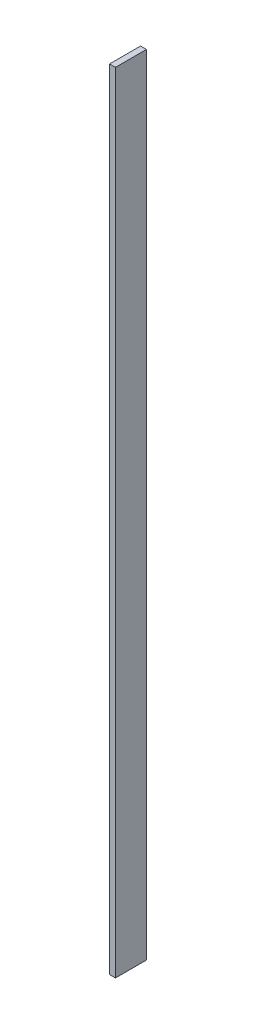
ISO-10303-21;
HEADER;
FILE_DESCRIPTION(('STEP AP214'),'2;1');
FILE_NAME('part.step','',(''),(''),'','','');
FILE_SCHEMA(('AUTOMOTIVE_DESIGN { 1 0 10303 214 1 1 1 1 }'));
ENDSEC;
DATA;
#1=APPLICATION_CONTEXT('core data for automotive mechanical design processes');
#2=APPLICATION_PROTOCOL_DEFINITION('international standard','automotive_design',2000,#1);
#3=PRODUCT_CONTEXT('',#1,'mechanical');
#4=PRODUCT('Part','Part','',(#3));
#5=PRODUCT_RELATED_PRODUCT_CATEGORY('part','',(#4));
#6=PRODUCT_DEFINITION_FORMATION('','',#4);
#7=PRODUCT_DEFINITION_CONTEXT('part definition',#1,'design');
#8=PRODUCT_DEFINITION('design','',#6,#7);
#9=PRODUCT_DEFINITION_SHAPE('','',#8);
#10=(LENGTH_UNIT() NAMED_UNIT(*) SI_UNIT(.MILLI.,.METRE.));
#11=(NAMED_UNIT(*) PLANE_ANGLE_UNIT() SI_UNIT($,.RADIAN.));
#12=(NAMED_UNIT(*) SI_UNIT($,.STERADIAN.) SOLID_ANGLE_UNIT());
#13=UNCERTAINTY_MEASURE_WITH_UNIT(LENGTH_MEASURE(1.E-05),#10,'distance_accuracy_value','');
#14=(GEOMETRIC_REPRESENTATION_CONTEXT(3) GLOBAL_UNCERTAINTY_ASSIGNED_CONTEXT((#13)) GLOBAL_UNIT_ASSIGNED_CONTEXT((#10,
#11,#12)) REPRESENTATION_CONTEXT('',''));
#15=CARTESIAN_POINT('',(0.,0.,0.));
#16=DIRECTION('',(0.,0.,1.));
#17=DIRECTION('',(1.,0.,0.));
#18=AXIS2_PLACEMENT_3D('',#15,#16,#17);
#19=CARTESIAN_POINT('',(0.,0.,31.5));
#20=DIRECTION('',(0.,0.,1.));
#21=DIRECTION('',(1.,0.,0.));
#22=AXIS2_PLACEMENT_3D('',#19,#20,#21);
#23=PLANE('',#22);
#24=DIRECTION('',(1.,0.,0.));
#25=VECTOR('',#24,1.);
#26=CARTESIAN_POINT('',(-3.,-400.,31.5));
#27=LINE('',#26,#25);
#28=CARTESIAN_POINT('',(-3.,-400.,31.5));
#29=VERTEX_POINT('',#28);
#30=CARTESIAN_POINT('',(3.,-400.,31.5));
#31=VERTEX_POINT('',#30);
#32=EDGE_CURVE('E93',#29,#31,#27,.T.);
#33=ORIENTED_EDGE('',*,*,#32,.T.);
#34=DIRECTION('',(0.,1.,0.));
#35=VECTOR('',#34,1.);
#36=CARTESIAN_POINT('',(3.,-400.,31.5));
#37=LINE('',#36,#35);
#38=CARTESIAN_POINT('',(3.,400.,31.5));
#39=VERTEX_POINT('',#38);
#40=EDGE_CURVE('E74',#31,#39,#37,.T.);
#41=ORIENTED_EDGE('',*,*,#40,.T.);
#42=DIRECTION('',(-1.,0.,0.));
#43=VECTOR('',#42,1.);
#44=CARTESIAN_POINT('',(3.,400.,31.5));
#45=LINE('',#44,#43);
#46=CARTESIAN_POINT('',(-3.,400.,31.5));
#47=VERTEX_POINT('',#46);
#48=EDGE_CURVE('E79',#39,#47,#45,.T.);
#49=ORIENTED_EDGE('',*,*,#48,.T.);
#50=DIRECTION('',(0.,-1.,0.));
#51=VECTOR('',#50,1.);
#52=CARTESIAN_POINT('',(-3.,400.,31.5));
#53=LINE('',#52,#51);
#54=EDGE_CURVE('E10',#47,#29,#53,.T.);
#55=ORIENTED_EDGE('',*,*,#54,.T.);
#56=EDGE_LOOP('',(#33,#41,#49,#55));
#57=FACE_BOUND('',#56,.T.);
#58=ADVANCED_FACE('F16',(#57),#23,.T.);
#59=CARTESIAN_POINT('',(0.,0.,0.));
#60=DIRECTION('',(0.,0.,1.));
#61=DIRECTION('',(1.,0.,0.));
#62=AXIS2_PLACEMENT_3D('',#59,#60,#61);
#63=PLANE('',#62);
#64=DIRECTION('',(0.,-1.,0.));
#65=VECTOR('',#64,1.);
#66=CARTESIAN_POINT('',(-3.,400.,0.));
#67=LINE('',#66,#65);
#68=CARTESIAN_POINT('',(-3.,400.,0.));
#69=VERTEX_POINT('',#68);
#70=CARTESIAN_POINT('',(-3.,-400.,0.));
#71=VERTEX_POINT('',#70);
#72=EDGE_CURVE('E20',#69,#71,#67,.T.);
#73=ORIENTED_EDGE('',*,*,#72,.F.);
#74=DIRECTION('',(-1.,0.,0.));
#75=VECTOR('',#74,1.);
#76=CARTESIAN_POINT('',(3.,400.,0.));
#77=LINE('',#76,#75);
#78=CARTESIAN_POINT('',(3.,400.,0.));
#79=VERTEX_POINT('',#78);
#80=EDGE_CURVE('E63',#79,#69,#77,.T.);
#81=ORIENTED_EDGE('',*,*,#80,.F.);
#82=DIRECTION('',(0.,1.,0.));
#83=VECTOR('',#82,1.);
#84=CARTESIAN_POINT('',(3.,-400.,0.));
#85=LINE('',#84,#83);
#86=CARTESIAN_POINT('',(3.,-400.,0.));
#87=VERTEX_POINT('',#86);
#88=EDGE_CURVE('E67',#87,#79,#85,.T.);
#89=ORIENTED_EDGE('',*,*,#88,.F.);
#90=DIRECTION('',(1.,0.,0.));
#91=VECTOR('',#90,1.);
#92=CARTESIAN_POINT('',(-3.,-400.,0.));
#93=LINE('',#92,#91);
#94=EDGE_CURVE('E110',#71,#87,#93,.T.);
#95=ORIENTED_EDGE('',*,*,#94,.F.);
#96=EDGE_LOOP('',(#73,#81,#89,#95));
#97=FACE_BOUND('',#96,.T.);
#98=ADVANCED_FACE('F18',(#97),#63,.F.);
#99=CARTESIAN_POINT('',(-3.,400.,0.));
#100=DIRECTION('',(1.,0.,0.));
#101=DIRECTION('',(0.,1.,0.));
#102=AXIS2_PLACEMENT_3D('',#99,#100,#101);
#103=PLANE('',#102);
#104=ORIENTED_EDGE('',*,*,#72,.T.);
#105=DIRECTION('',(0.,0.,1.));
#106=VECTOR('',#105,1.);
#107=CARTESIAN_POINT('',(-3.,-400.,0.));
#108=LINE('',#107,#106);
#109=EDGE_CURVE('E89',#71,#29,#108,.T.);
#110=ORIENTED_EDGE('',*,*,#109,.T.);
#111=ORIENTED_EDGE('',*,*,#54,.F.);
#112=DIRECTION('',(0.,0.,1.));
#113=VECTOR('',#112,1.);
#114=CARTESIAN_POINT('',(-3.,400.,0.));
#115=LINE('',#114,#113);
#116=EDGE_CURVE('E73',#69,#47,#115,.T.);
#117=ORIENTED_EDGE('',*,*,#116,.F.);
#118=EDGE_LOOP('',(#104,#110,#111,#117));
#119=FACE_BOUND('',#118,.T.);
#120=ADVANCED_FACE('F106',(#119),#103,.F.);
#121=CARTESIAN_POINT('',(3.,400.,0.));
#122=DIRECTION('',(0.,-1.,0.));
#123=DIRECTION('',(0.,0.,-1.));
#124=AXIS2_PLACEMENT_3D('',#121,#122,#123);
#125=PLANE('',#124);
#126=ORIENTED_EDGE('',*,*,#80,.T.);
#127=ORIENTED_EDGE('',*,*,#116,.T.);
#128=ORIENTED_EDGE('',*,*,#48,.F.);
#129=DIRECTION('',(0.,0.,1.));
#130=VECTOR('',#129,1.);
#131=CARTESIAN_POINT('',(3.,400.,0.));
#132=LINE('',#131,#130);
#133=EDGE_CURVE('E77',#79,#39,#132,.T.);
#134=ORIENTED_EDGE('',*,*,#133,.F.);
#135=EDGE_LOOP('',(#126,#127,#128,#134));
#136=FACE_BOUND('',#135,.T.);
#137=ADVANCED_FACE('F78',(#136),#125,.F.);
#138=CARTESIAN_POINT('',(3.,-400.,0.));
#139=DIRECTION('',(-1.,0.,0.));
#140=DIRECTION('',(0.,0.,1.));
#141=AXIS2_PLACEMENT_3D('',#138,#139,#140);
#142=PLANE('',#141);
#143=ORIENTED_EDGE('',*,*,#88,.T.);
#144=ORIENTED_EDGE('',*,*,#133,.T.);
#145=ORIENTED_EDGE('',*,*,#40,.F.);
#146=DIRECTION('',(0.,0.,1.));
#147=VECTOR('',#146,1.);
#148=CARTESIAN_POINT('',(3.,-400.,0.));
#149=LINE('',#148,#147);
#150=EDGE_CURVE('E86',#87,#31,#149,.T.);
#151=ORIENTED_EDGE('',*,*,#150,.F.);
#152=EDGE_LOOP('',(#143,#144,#145,#151));
#153=FACE_BOUND('',#152,.T.);
#154=ADVANCED_FACE('F84',(#153),#142,.F.);
#155=CARTESIAN_POINT('',(-3.,-400.,0.));
#156=DIRECTION('',(0.,1.,0.));
#157=DIRECTION('',(1.,0.,0.));
#158=AXIS2_PLACEMENT_3D('',#155,#156,#157);
#159=PLANE('',#158);
#160=ORIENTED_EDGE('',*,*,#94,.T.);
#161=ORIENTED_EDGE('',*,*,#150,.T.);
#162=ORIENTED_EDGE('',*,*,#32,.F.);
#163=ORIENTED_EDGE('',*,*,#109,.F.);
#164=EDGE_LOOP('',(#160,#161,#162,#163));
#165=FACE_BOUND('',#164,.T.);
#166=ADVANCED_FACE('F109',(#165),#159,.F.);
#167=CLOSED_SHELL('',(#58,#98,#120,#137,#154,#166));
#168=MANIFOLD_SOLID_BREP('B1',#167);
#169=ADVANCED_BREP_SHAPE_REPRESENTATION('',(#18,#168),#14);
#170=SHAPE_DEFINITION_REPRESENTATION(#9,#169);
ENDSEC;
END-ISO-10303-21;
